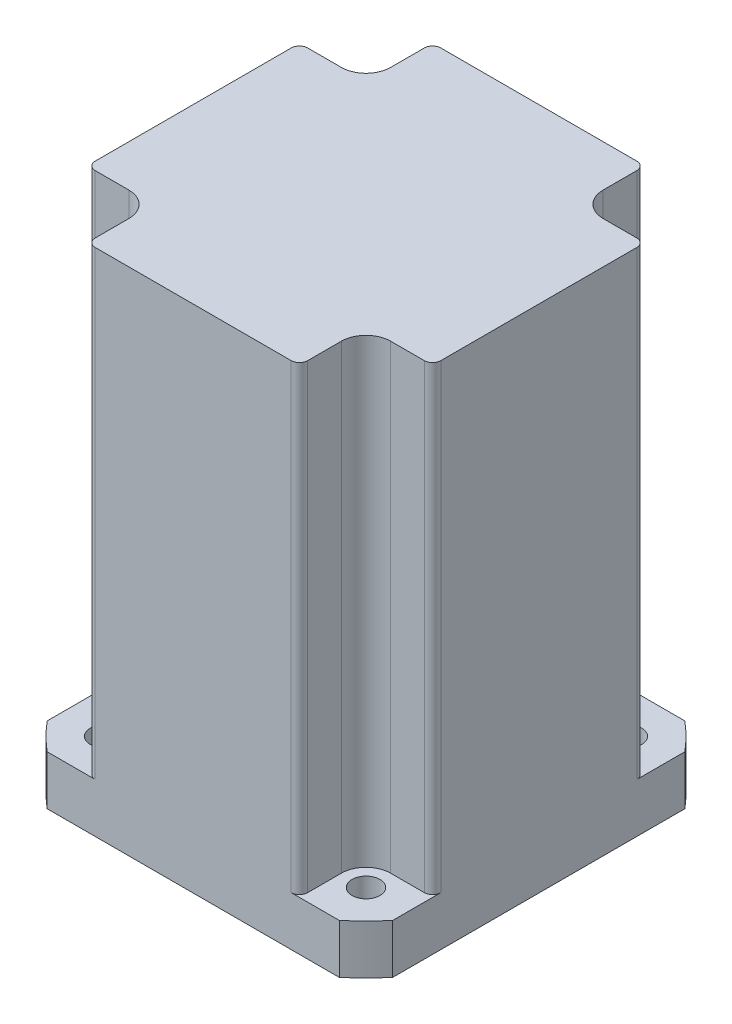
ISO-10303-21;
HEADER;
FILE_DESCRIPTION(('STEP AP214'),'2;1');
FILE_NAME('part.step','',(''),(''),'','','');
FILE_SCHEMA(('AUTOMOTIVE_DESIGN { 1 0 10303 214 1 1 1 1 }'));
ENDSEC;
DATA;
#1=APPLICATION_CONTEXT('core data for automotive mechanical design processes');
#2=APPLICATION_PROTOCOL_DEFINITION('international standard','automotive_design',2000,#1);
#3=PRODUCT_CONTEXT('',#1,'mechanical');
#4=PRODUCT('Part','Part','',(#3));
#5=PRODUCT_RELATED_PRODUCT_CATEGORY('part','',(#4));
#6=PRODUCT_DEFINITION_FORMATION('','',#4);
#7=PRODUCT_DEFINITION_CONTEXT('part definition',#1,'design');
#8=PRODUCT_DEFINITION('design','',#6,#7);
#9=PRODUCT_DEFINITION_SHAPE('','',#8);
#10=(LENGTH_UNIT() NAMED_UNIT(*) SI_UNIT(.MILLI.,.METRE.));
#11=(NAMED_UNIT(*) PLANE_ANGLE_UNIT() SI_UNIT($,.RADIAN.));
#12=(NAMED_UNIT(*) SI_UNIT($,.STERADIAN.) SOLID_ANGLE_UNIT());
#13=UNCERTAINTY_MEASURE_WITH_UNIT(LENGTH_MEASURE(1.E-05),#10,'distance_accuracy_value','');
#14=(GEOMETRIC_REPRESENTATION_CONTEXT(3) GLOBAL_UNCERTAINTY_ASSIGNED_CONTEXT((#13)) GLOBAL_UNIT_ASSIGNED_CONTEXT((#10,
#11,#12)) REPRESENTATION_CONTEXT('',''));
#15=CARTESIAN_POINT('',(0.,0.,0.));
#16=DIRECTION('',(0.,0.,1.));
#17=DIRECTION('',(1.,0.,0.));
#18=AXIS2_PLACEMENT_3D('',#15,#16,#17);
#19=CARTESIAN_POINT('',(-12.9099025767,62.,-12.9099025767));
#20=DIRECTION('',(-1.,0.,0.));
#21=DIRECTION('',(0.,0.,1.));
#22=AXIS2_PLACEMENT_3D('',#19,#20,#21);
#23=PLANE('',#22);
#24=DIRECTION('',(0.,0.,-1.));
#25=VECTOR('',#24,1.);
#26=CARTESIAN_POINT('',(-12.9099025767,62.,21.));
#27=LINE('',#26,#25);
#28=CARTESIAN_POINT('',(-12.9099025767,62.,20.));
#29=VERTEX_POINT('',#28);
#30=CARTESIAN_POINT('',(-12.9099025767,62.,15.9099025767));
#31=VERTEX_POINT('',#30);
#32=EDGE_CURVE('E440',#29,#31,#27,.T.);
#33=ORIENTED_EDGE('',*,*,#32,.T.);
#34=DIRECTION('',(0.,1.,0.));
#35=VECTOR('',#34,1.);
#36=CARTESIAN_POINT('',(-12.9099025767,62.,15.9099025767));
#37=LINE('',#36,#35);
#38=CARTESIAN_POINT('',(-12.9099025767,6.00000000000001,15.9099025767));
#39=VERTEX_POINT('',#38);
#40=EDGE_CURVE('E435',#31,#39,#37,.F.);
#41=ORIENTED_EDGE('',*,*,#40,.T.);
#42=DIRECTION('',(0.,0.,1.));
#43=VECTOR('',#42,1.);
#44=CARTESIAN_POINT('',(-12.9099025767,6.00000000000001,-12.9099025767));
#45=LINE('',#44,#43);
#46=CARTESIAN_POINT('',(-12.9099025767,6.00000000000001,20.));
#47=VERTEX_POINT('',#46);
#48=EDGE_CURVE('E436',#39,#47,#45,.T.);
#49=ORIENTED_EDGE('',*,*,#48,.T.);
#50=DIRECTION('',(0.,1.,0.));
#51=VECTOR('',#50,1.);
#52=CARTESIAN_POINT('',(-12.9099025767,62.,20.));
#53=LINE('',#52,#51);
#54=EDGE_CURVE('E414',#47,#29,#53,.T.);
#55=ORIENTED_EDGE('',*,*,#54,.T.);
#56=EDGE_LOOP('',(#33,#41,#49,#55));
#57=FACE_BOUND('',#56,.T.);
#58=ADVANCED_FACE('F34',(#57),#23,.T.);
#59=CARTESIAN_POINT('',(12.9099025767,62.,-12.9099025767));
#60=DIRECTION('',(-1.,0.,0.));
#61=DIRECTION('',(0.,0.,1.));
#62=AXIS2_PLACEMENT_3D('',#59,#60,#61);
#63=PLANE('',#62);
#64=DIRECTION('',(0.,0.,1.));
#65=VECTOR('',#64,1.);
#66=CARTESIAN_POINT('',(12.9099025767,6.00000000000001,-12.9099025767));
#67=LINE('',#66,#65);
#68=CARTESIAN_POINT('',(12.9099025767,6.00000000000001,15.9099025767));
#69=VERTEX_POINT('',#68);
#70=CARTESIAN_POINT('',(12.9099025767,6.00000000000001,20.));
#71=VERTEX_POINT('',#70);
#72=EDGE_CURVE('E401',#69,#71,#67,.T.);
#73=ORIENTED_EDGE('',*,*,#72,.F.);
#74=DIRECTION('',(0.,-1.,0.));
#75=VECTOR('',#74,1.);
#76=CARTESIAN_POINT('',(12.9099025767,62.,15.9099025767));
#77=LINE('',#76,#75);
#78=CARTESIAN_POINT('',(12.9099025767,62.,15.9099025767));
#79=VERTEX_POINT('',#78);
#80=EDGE_CURVE('E49',#69,#79,#77,.F.);
#81=ORIENTED_EDGE('',*,*,#80,.T.);
#82=DIRECTION('',(0.,0.,-1.));
#83=VECTOR('',#82,1.);
#84=CARTESIAN_POINT('',(12.9099025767,62.,21.));
#85=LINE('',#84,#83);
#86=CARTESIAN_POINT('',(12.9099025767,62.,20.));
#87=VERTEX_POINT('',#86);
#88=EDGE_CURVE('E454',#87,#79,#85,.T.);
#89=ORIENTED_EDGE('',*,*,#88,.F.);
#90=DIRECTION('',(0.,1.,0.));
#91=VECTOR('',#90,1.);
#92=CARTESIAN_POINT('',(12.9099025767,6.00000000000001,20.));
#93=LINE('',#92,#91);
#94=EDGE_CURVE('E412',#87,#71,#93,.F.);
#95=ORIENTED_EDGE('',*,*,#94,.T.);
#96=EDGE_LOOP('',(#73,#81,#89,#95));
#97=FACE_BOUND('',#96,.T.);
#98=ADVANCED_FACE('F659',(#97),#63,.F.);
#99=CARTESIAN_POINT('',(12.9099025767,62.,21.));
#100=DIRECTION('',(0.,1.,0.));
#101=DIRECTION('',(0.,0.,1.));
#102=AXIS2_PLACEMENT_3D('',#99,#100,#101);
#103=PLANE('',#102);
#104=DIRECTION('',(0.,0.,1.));
#105=VECTOR('',#104,1.);
#106=CARTESIAN_POINT('',(21.,62.,12.9099025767));
#107=LINE('',#106,#105);
#108=CARTESIAN_POINT('',(21.,62.,-11.9099025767));
#109=VERTEX_POINT('',#108);
#110=CARTESIAN_POINT('',(21.,62.,11.9099025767));
#111=VERTEX_POINT('',#110);
#112=EDGE_CURVE('E479',#109,#111,#107,.T.);
#113=ORIENTED_EDGE('',*,*,#112,.F.);
#114=CARTESIAN_POINT('',(20.,62.,-11.9099025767));
#115=DIRECTION('',(0.,1.,0.));
#116=DIRECTION('',(0.,0.,1.));
#117=AXIS2_PLACEMENT_3D('',#114,#115,#116);
#118=CIRCLE('',#117,1.);
#119=CARTESIAN_POINT('',(20.,62.,-12.9099025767));
#120=VERTEX_POINT('',#119);
#121=EDGE_CURVE('E514',#109,#120,#118,.T.);
#122=ORIENTED_EDGE('',*,*,#121,.T.);
#123=DIRECTION('',(-1.,0.,0.));
#124=VECTOR('',#123,1.);
#125=CARTESIAN_POINT('',(12.9099025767,62.,-12.9099025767));
#126=LINE('',#125,#124);
#127=CARTESIAN_POINT('',(15.9099025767,62.,-12.9099025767));
#128=VERTEX_POINT('',#127);
#129=EDGE_CURVE('E480',#120,#128,#126,.T.);
#130=ORIENTED_EDGE('',*,*,#129,.T.);
#131=CARTESIAN_POINT('',(15.9099025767,62.,-15.9099025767));
#132=DIRECTION('',(0.,1.,0.));
#133=DIRECTION('',(0.,0.,1.));
#134=AXIS2_PLACEMENT_3D('',#131,#132,#133);
#135=CIRCLE('',#134,3.);
#136=CARTESIAN_POINT('',(12.9099025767,62.,-15.9099025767));
#137=VERTEX_POINT('',#136);
#138=EDGE_CURVE('E42',#128,#137,#135,.F.);
#139=ORIENTED_EDGE('',*,*,#138,.T.);
#140=DIRECTION('',(0.,0.,1.));
#141=VECTOR('',#140,1.);
#142=CARTESIAN_POINT('',(12.9099025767,62.,-21.));
#143=LINE('',#142,#141);
#144=CARTESIAN_POINT('',(12.9099025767,62.,-20.));
#145=VERTEX_POINT('',#144);
#146=EDGE_CURVE('E463',#145,#137,#143,.T.);
#147=ORIENTED_EDGE('',*,*,#146,.F.);
#148=CARTESIAN_POINT('',(11.9099025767,62.,-20.));
#149=DIRECTION('',(0.,1.,0.));
#150=DIRECTION('',(0.,0.,1.));
#151=AXIS2_PLACEMENT_3D('',#148,#149,#150);
#152=CIRCLE('',#151,1.);
#153=CARTESIAN_POINT('',(11.9099025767,62.,-21.));
#154=VERTEX_POINT('',#153);
#155=EDGE_CURVE('E530',#145,#154,#152,.T.);
#156=ORIENTED_EDGE('',*,*,#155,.T.);
#157=DIRECTION('',(1.,0.,0.));
#158=VECTOR('',#157,1.);
#159=CARTESIAN_POINT('',(12.9099025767,62.,-21.));
#160=LINE('',#159,#158);
#161=CARTESIAN_POINT('',(-11.9099025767,62.,-21.));
#162=VERTEX_POINT('',#161);
#163=EDGE_CURVE('E464',#162,#154,#160,.T.);
#164=ORIENTED_EDGE('',*,*,#163,.F.);
#165=CARTESIAN_POINT('',(-11.9099025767,62.,-20.));
#166=DIRECTION('',(0.,1.,0.));
#167=DIRECTION('',(0.,0.,1.));
#168=AXIS2_PLACEMENT_3D('',#165,#166,#167);
#169=CIRCLE('',#168,1.);
#170=CARTESIAN_POINT('',(-12.9099025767,62.,-20.));
#171=VERTEX_POINT('',#170);
#172=EDGE_CURVE('E526',#162,#171,#169,.T.);
#173=ORIENTED_EDGE('',*,*,#172,.T.);
#174=CARTESIAN_POINT('',(-12.9099025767,62.,-15.9099025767));
#175=VERTEX_POINT('',#174);
#176=EDGE_CURVE('E542',#175,#171,#27,.T.);
#177=ORIENTED_EDGE('',*,*,#176,.F.);
#178=CARTESIAN_POINT('',(-15.9099025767,62.,-15.9099025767));
#179=DIRECTION('',(0.,1.,0.));
#180=DIRECTION('',(0.,0.,1.));
#181=AXIS2_PLACEMENT_3D('',#178,#179,#180);
#182=CIRCLE('',#181,3.);
#183=CARTESIAN_POINT('',(-15.9099025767,62.,-12.9099025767));
#184=VERTEX_POINT('',#183);
#185=EDGE_CURVE('E570',#175,#184,#182,.F.);
#186=ORIENTED_EDGE('',*,*,#185,.T.);
#187=DIRECTION('',(1.,0.,0.));
#188=VECTOR('',#187,1.);
#189=CARTESIAN_POINT('',(-21.,62.,-12.9099025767));
#190=LINE('',#189,#188);
#191=CARTESIAN_POINT('',(-20.,62.,-12.9099025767));
#192=VERTEX_POINT('',#191);
#193=EDGE_CURVE('E483',#192,#184,#190,.T.);
#194=ORIENTED_EDGE('',*,*,#193,.F.);
#195=CARTESIAN_POINT('',(-20.,62.,-11.9099025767));
#196=DIRECTION('',(0.,1.,0.));
#197=DIRECTION('',(0.,0.,1.));
#198=AXIS2_PLACEMENT_3D('',#195,#196,#197);
#199=CIRCLE('',#198,1.);
#200=CARTESIAN_POINT('',(-21.,62.,-11.9099025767));
#201=VERTEX_POINT('',#200);
#202=EDGE_CURVE('E643',#192,#201,#199,.T.);
#203=ORIENTED_EDGE('',*,*,#202,.T.);
#204=DIRECTION('',(0.,0.,-1.));
#205=VECTOR('',#204,1.);
#206=CARTESIAN_POINT('',(-21.,62.,-12.9099025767));
#207=LINE('',#206,#205);
#208=CARTESIAN_POINT('',(-21.,62.,11.9099025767));
#209=VERTEX_POINT('',#208);
#210=EDGE_CURVE('E268',#209,#201,#207,.T.);
#211=ORIENTED_EDGE('',*,*,#210,.F.);
#212=CARTESIAN_POINT('',(-20.,62.,11.9099025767));
#213=DIRECTION('',(0.,1.,0.));
#214=DIRECTION('',(0.,0.,1.));
#215=AXIS2_PLACEMENT_3D('',#212,#213,#214);
#216=CIRCLE('',#215,1.);
#217=CARTESIAN_POINT('',(-20.,62.,12.9099025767));
#218=VERTEX_POINT('',#217);
#219=EDGE_CURVE('E624',#209,#218,#216,.T.);
#220=ORIENTED_EDGE('',*,*,#219,.T.);
#221=DIRECTION('',(1.,0.,0.));
#222=VECTOR('',#221,1.);
#223=CARTESIAN_POINT('',(-21.,62.,12.9099025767));
#224=LINE('',#223,#222);
#225=CARTESIAN_POINT('',(-15.9099025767,62.,12.9099025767));
#226=VERTEX_POINT('',#225);
#227=EDGE_CURVE('E486',#218,#226,#224,.T.);
#228=ORIENTED_EDGE('',*,*,#227,.T.);
#229=CARTESIAN_POINT('',(-15.9099025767,62.,15.9099025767));
#230=DIRECTION('',(0.,1.,0.));
#231=DIRECTION('',(0.,0.,1.));
#232=AXIS2_PLACEMENT_3D('',#229,#230,#231);
#233=CIRCLE('',#232,3.);
#234=EDGE_CURVE('E568',#226,#31,#233,.F.);
#235=ORIENTED_EDGE('',*,*,#234,.T.);
#236=ORIENTED_EDGE('',*,*,#32,.F.);
#237=CARTESIAN_POINT('',(-11.9099025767,62.,20.));
#238=DIRECTION('',(0.,1.,0.));
#239=DIRECTION('',(0.,0.,1.));
#240=AXIS2_PLACEMENT_3D('',#237,#238,#239);
#241=CIRCLE('',#240,1.);
#242=CARTESIAN_POINT('',(-11.9099025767,62.,21.));
#243=VERTEX_POINT('',#242);
#244=EDGE_CURVE('E588',#29,#243,#241,.T.);
#245=ORIENTED_EDGE('',*,*,#244,.T.);
#246=DIRECTION('',(-1.,0.,0.));
#247=VECTOR('',#246,1.);
#248=CARTESIAN_POINT('',(12.9099025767,62.,21.));
#249=LINE('',#248,#247);
#250=CARTESIAN_POINT('',(11.9099025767,62.,21.));
#251=VERTEX_POINT('',#250);
#252=EDGE_CURVE('E447',#251,#243,#249,.T.);
#253=ORIENTED_EDGE('',*,*,#252,.F.);
#254=CARTESIAN_POINT('',(11.9099025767,62.,20.));
#255=DIRECTION('',(0.,1.,0.));
#256=DIRECTION('',(0.,0.,1.));
#257=AXIS2_PLACEMENT_3D('',#254,#255,#256);
#258=CIRCLE('',#257,1.);
#259=EDGE_CURVE('E410',#251,#87,#258,.T.);
#260=ORIENTED_EDGE('',*,*,#259,.T.);
#261=ORIENTED_EDGE('',*,*,#88,.T.);
#262=CARTESIAN_POINT('',(15.9099025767,62.,15.9099025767));
#263=DIRECTION('',(0.,1.,0.));
#264=DIRECTION('',(0.,0.,1.));
#265=AXIS2_PLACEMENT_3D('',#262,#263,#264);
#266=CIRCLE('',#265,3.);
#267=CARTESIAN_POINT('',(15.9099025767,62.,12.9099025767));
#268=VERTEX_POINT('',#267);
#269=EDGE_CURVE('E11',#79,#268,#266,.F.);
#270=ORIENTED_EDGE('',*,*,#269,.T.);
#271=DIRECTION('',(-1.,0.,0.));
#272=VECTOR('',#271,1.);
#273=CARTESIAN_POINT('',(21.,62.,12.9099025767));
#274=LINE('',#273,#272);
#275=CARTESIAN_POINT('',(20.,62.,12.9099025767));
#276=VERTEX_POINT('',#275);
#277=EDGE_CURVE('E505',#276,#268,#274,.T.);
#278=ORIENTED_EDGE('',*,*,#277,.F.);
#279=CARTESIAN_POINT('',(20.,62.,11.9099025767));
#280=DIRECTION('',(0.,1.,0.));
#281=DIRECTION('',(0.,0.,1.));
#282=AXIS2_PLACEMENT_3D('',#279,#280,#281);
#283=CIRCLE('',#282,1.);
#284=EDGE_CURVE('E646',#276,#111,#283,.T.);
#285=ORIENTED_EDGE('',*,*,#284,.T.);
#286=EDGE_LOOP('',(#113,#122,#130,#139,#147,#156,#164,#173,#177,#186,#194,#203,#211,#220,#228,
#235,#236,#245,#253,#260,#261,#270,#278,#285));
#287=FACE_BOUND('',#286,.T.);
#288=ADVANCED_FACE('F524',(#287),#103,.T.);
#289=CARTESIAN_POINT('',(12.9099025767,6.00000000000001,21.));
#290=DIRECTION('',(0.,0.,1.));
#291=DIRECTION('',(1.,0.,0.));
#292=AXIS2_PLACEMENT_3D('',#289,#290,#291);
#293=PLANE('',#292);
#294=DIRECTION('',(-1.,0.,0.));
#295=VECTOR('',#294,1.);
#296=CARTESIAN_POINT('',(-17.7552809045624,6.00000000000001,21.));
#297=LINE('',#296,#295);
#298=CARTESIAN_POINT('',(17.7552809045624,6.00000000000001,21.));
#299=VERTEX_POINT('',#298);
#300=CARTESIAN_POINT('',(11.9099025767,6.00000000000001,21.));
#301=VERTEX_POINT('',#300);
#302=EDGE_CURVE('E336',#299,#301,#297,.T.);
#303=ORIENTED_EDGE('',*,*,#302,.T.);
#304=DIRECTION('',(0.,1.,0.));
#305=VECTOR('',#304,1.);
#306=CARTESIAN_POINT('',(11.9099025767,62.,21.));
#307=LINE('',#306,#305);
#308=EDGE_CURVE('E408',#301,#251,#307,.T.);
#309=ORIENTED_EDGE('',*,*,#308,.T.);
#310=ORIENTED_EDGE('',*,*,#252,.T.);
#311=DIRECTION('',(0.,1.,0.));
#312=VECTOR('',#311,1.);
#313=CARTESIAN_POINT('',(-11.9099025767,6.00000000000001,21.));
#314=LINE('',#313,#312);
#315=CARTESIAN_POINT('',(-11.9099025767,6.00000000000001,21.));
#316=VERTEX_POINT('',#315);
#317=EDGE_CURVE('E348',#243,#316,#314,.F.);
#318=ORIENTED_EDGE('',*,*,#317,.T.);
#319=CARTESIAN_POINT('',(-17.7552809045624,6.00000000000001,21.));
#320=VERTEX_POINT('',#319);
#321=EDGE_CURVE('E324',#316,#320,#297,.T.);
#322=ORIENTED_EDGE('',*,*,#321,.T.);
#323=DIRECTION('',(0.,1.,0.));
#324=VECTOR('',#323,1.);
#325=CARTESIAN_POINT('',(-17.7552809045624,0.,21.));
#326=LINE('',#325,#324);
#327=CARTESIAN_POINT('',(-17.7552809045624,0.,21.));
#328=VERTEX_POINT('',#327);
#329=EDGE_CURVE('E292',#328,#320,#326,.T.);
#330=ORIENTED_EDGE('',*,*,#329,.F.);
#331=DIRECTION('',(-1.,0.,0.));
#332=VECTOR('',#331,1.);
#333=CARTESIAN_POINT('',(-17.7552809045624,0.,21.));
#334=LINE('',#333,#332);
#335=CARTESIAN_POINT('',(17.7552809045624,0.,21.));
#336=VERTEX_POINT('',#335);
#337=EDGE_CURVE('E371',#336,#328,#334,.T.);
#338=ORIENTED_EDGE('',*,*,#337,.F.);
#339=DIRECTION('',(0.,1.,0.));
#340=VECTOR('',#339,1.);
#341=CARTESIAN_POINT('',(17.7552809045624,0.,21.));
#342=LINE('',#341,#340);
#343=EDGE_CURVE('E295',#336,#299,#342,.T.);
#344=ORIENTED_EDGE('',*,*,#343,.T.);
#345=EDGE_LOOP('',(#303,#309,#310,#318,#322,#330,#338,#344));
#346=FACE_BOUND('',#345,.T.);
#347=ADVANCED_FACE('F343',(#346),#293,.T.);
#348=CARTESIAN_POINT('',(12.9099025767,62.,-12.9099025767));
#349=DIRECTION('',(0.,0.,-1.));
#350=DIRECTION('',(0.,1.,0.));
#351=AXIS2_PLACEMENT_3D('',#348,#349,#350);
#352=PLANE('',#351);
#353=DIRECTION('',(-1.,0.,0.));
#354=VECTOR('',#353,1.);
#355=CARTESIAN_POINT('',(12.9099025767,6.00000000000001,-12.9099025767));
#356=LINE('',#355,#354);
#357=CARTESIAN_POINT('',(20.,6.00000000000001,-12.9099025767));
#358=VERTEX_POINT('',#357);
#359=CARTESIAN_POINT('',(15.9099025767,6.00000000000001,-12.9099025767));
#360=VERTEX_POINT('',#359);
#361=EDGE_CURVE('E510',#358,#360,#356,.T.);
#362=ORIENTED_EDGE('',*,*,#361,.T.);
#363=DIRECTION('',(0.,-1.,0.));
#364=VECTOR('',#363,1.);
#365=CARTESIAN_POINT('',(15.9099025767,62.,-12.9099025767));
#366=LINE('',#365,#364);
#367=EDGE_CURVE('E561',#360,#128,#366,.F.);
#368=ORIENTED_EDGE('',*,*,#367,.T.);
#369=ORIENTED_EDGE('',*,*,#129,.F.);
#370=DIRECTION('',(0.,1.,0.));
#371=VECTOR('',#370,1.);
#372=CARTESIAN_POINT('',(20.,6.00000000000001,-12.9099025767));
#373=LINE('',#372,#371);
#374=EDGE_CURVE('E516',#120,#358,#373,.F.);
#375=ORIENTED_EDGE('',*,*,#374,.T.);
#376=EDGE_LOOP('',(#362,#368,#369,#375));
#377=FACE_BOUND('',#376,.T.);
#378=ADVANCED_FACE('F583',(#377),#352,.T.);
#379=CARTESIAN_POINT('',(-12.9099025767,6.00000000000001,-20.));
#380=VERTEX_POINT('',#379);
#381=CARTESIAN_POINT('',(-12.9099025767,6.00000000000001,-15.9099025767));
#382=VERTEX_POINT('',#381);
#383=EDGE_CURVE('E439',#380,#382,#45,.T.);
#384=ORIENTED_EDGE('',*,*,#383,.T.);
#385=DIRECTION('',(0.,-1.,0.));
#386=VECTOR('',#385,1.);
#387=CARTESIAN_POINT('',(-12.9099025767,62.,-15.9099025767));
#388=LINE('',#387,#386);
#389=EDGE_CURVE('E554',#382,#175,#388,.F.);
#390=ORIENTED_EDGE('',*,*,#389,.T.);
#391=ORIENTED_EDGE('',*,*,#176,.T.);
#392=DIRECTION('',(0.,1.,0.));
#393=VECTOR('',#392,1.);
#394=CARTESIAN_POINT('',(-12.9099025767,6.00000000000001,-20.));
#395=LINE('',#394,#393);
#396=EDGE_CURVE('E457',#171,#380,#395,.F.);
#397=ORIENTED_EDGE('',*,*,#396,.T.);
#398=EDGE_LOOP('',(#384,#390,#391,#397));
#399=FACE_BOUND('',#398,.T.);
#400=ADVANCED_FACE('F668',(#399),#23,.T.);
#401=CARTESIAN_POINT('',(21.,6.00000000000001,12.9099025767));
#402=DIRECTION('',(0.,0.,-1.));
#403=DIRECTION('',(-1.,0.,0.));
#404=AXIS2_PLACEMENT_3D('',#401,#402,#403);
#405=PLANE('',#404);
#406=ORIENTED_EDGE('',*,*,#277,.T.);
#407=DIRECTION('',(0.,-1.,0.));
#408=VECTOR('',#407,1.);
#409=CARTESIAN_POINT('',(15.9099025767,6.00000000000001,12.9099025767));
#410=LINE('',#409,#408);
#411=CARTESIAN_POINT('',(15.9099025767,6.00000000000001,12.9099025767));
#412=VERTEX_POINT('',#411);
#413=EDGE_CURVE('E563',#268,#412,#410,.T.);
#414=ORIENTED_EDGE('',*,*,#413,.T.);
#415=DIRECTION('',(-1.,0.,0.));
#416=VECTOR('',#415,1.);
#417=CARTESIAN_POINT('',(21.,6.00000000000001,12.9099025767));
#418=LINE('',#417,#416);
#419=CARTESIAN_POINT('',(20.,6.00000000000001,12.9099025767));
#420=VERTEX_POINT('',#419);
#421=EDGE_CURVE('E504',#420,#412,#418,.T.);
#422=ORIENTED_EDGE('',*,*,#421,.F.);
#423=DIRECTION('',(0.,-1.,0.));
#424=VECTOR('',#423,1.);
#425=CARTESIAN_POINT('',(20.,6.00000000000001,12.9099025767));
#426=LINE('',#425,#424);
#427=EDGE_CURVE('E416',#420,#276,#426,.F.);
#428=ORIENTED_EDGE('',*,*,#427,.T.);
#429=EDGE_LOOP('',(#406,#414,#422,#428));
#430=FACE_BOUND('',#429,.T.);
#431=ADVANCED_FACE('F656',(#430),#405,.F.);
#432=CARTESIAN_POINT('',(21.,6.00000000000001,-12.9099025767));
#433=DIRECTION('',(-1.,0.,0.));
#434=DIRECTION('',(0.,-1.,0.));
#435=AXIS2_PLACEMENT_3D('',#432,#433,#434);
#436=PLANE('',#435);
#437=DIRECTION('',(0.,0.,1.));
#438=VECTOR('',#437,1.);
#439=CARTESIAN_POINT('',(21.,6.00000000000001,17.7552809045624));
#440=LINE('',#439,#438);
#441=CARTESIAN_POINT('',(21.,6.00000000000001,-17.7552809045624));
#442=VERTEX_POINT('',#441);
#443=CARTESIAN_POINT('',(21.,6.00000000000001,-11.9099025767));
#444=VERTEX_POINT('',#443);
#445=EDGE_CURVE('E307',#442,#444,#440,.T.);
#446=ORIENTED_EDGE('',*,*,#445,.T.);
#447=DIRECTION('',(0.,1.,0.));
#448=VECTOR('',#447,1.);
#449=CARTESIAN_POINT('',(21.,62.,-11.9099025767));
#450=LINE('',#449,#448);
#451=EDGE_CURVE('E587',#444,#109,#450,.T.);
#452=ORIENTED_EDGE('',*,*,#451,.T.);
#453=ORIENTED_EDGE('',*,*,#112,.T.);
#454=DIRECTION('',(0.,-1.,0.));
#455=VECTOR('',#454,1.);
#456=CARTESIAN_POINT('',(21.,6.00000000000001,11.9099025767));
#457=LINE('',#456,#455);
#458=CARTESIAN_POINT('',(21.,6.00000000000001,11.9099025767));
#459=VERTEX_POINT('',#458);
#460=EDGE_CURVE('E589',#111,#459,#457,.T.);
#461=ORIENTED_EDGE('',*,*,#460,.T.);
#462=CARTESIAN_POINT('',(21.,6.00000000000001,17.7552809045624));
#463=VERTEX_POINT('',#462);
#464=EDGE_CURVE('E322',#459,#463,#440,.T.);
#465=ORIENTED_EDGE('',*,*,#464,.T.);
#466=DIRECTION('',(0.,1.,0.));
#467=VECTOR('',#466,1.);
#468=CARTESIAN_POINT('',(21.,0.,17.7552809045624));
#469=LINE('',#468,#467);
#470=CARTESIAN_POINT('',(21.,0.,17.7552809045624));
#471=VERTEX_POINT('',#470);
#472=EDGE_CURVE('E298',#471,#463,#469,.T.);
#473=ORIENTED_EDGE('',*,*,#472,.F.);
#474=DIRECTION('',(0.,0.,1.));
#475=VECTOR('',#474,1.);
#476=CARTESIAN_POINT('',(21.,0.,17.7552809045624));
#477=LINE('',#476,#475);
#478=CARTESIAN_POINT('',(21.,0.,-17.7552809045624));
#479=VERTEX_POINT('',#478);
#480=EDGE_CURVE('E310',#479,#471,#477,.T.);
#481=ORIENTED_EDGE('',*,*,#480,.F.);
#482=DIRECTION('',(0.,1.,0.));
#483=VECTOR('',#482,1.);
#484=CARTESIAN_POINT('',(21.,0.,-17.7552809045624));
#485=LINE('',#484,#483);
#486=EDGE_CURVE('E273',#479,#442,#485,.T.);
#487=ORIENTED_EDGE('',*,*,#486,.T.);
#488=EDGE_LOOP('',(#446,#452,#453,#461,#465,#473,#481,#487));
#489=FACE_BOUND('',#488,.T.);
#490=ADVANCED_FACE('F305',(#489),#436,.F.);
#491=CARTESIAN_POINT('',(12.9099025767,6.00000000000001,-21.));
#492=DIRECTION('',(-1.,0.,0.));
#493=DIRECTION('',(0.,0.,1.));
#494=AXIS2_PLACEMENT_3D('',#491,#492,#493);
#495=PLANE('',#494);
#496=ORIENTED_EDGE('',*,*,#146,.T.);
#497=DIRECTION('',(0.,-1.,0.));
#498=VECTOR('',#497,1.);
#499=CARTESIAN_POINT('',(12.9099025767,6.00000000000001,-15.9099025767));
#500=LINE('',#499,#498);
#501=CARTESIAN_POINT('',(12.9099025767,6.00000000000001,-15.9099025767));
#502=VERTEX_POINT('',#501);
#503=EDGE_CURVE('E556',#137,#502,#500,.T.);
#504=ORIENTED_EDGE('',*,*,#503,.T.);
#505=DIRECTION('',(0.,0.,1.));
#506=VECTOR('',#505,1.);
#507=CARTESIAN_POINT('',(12.9099025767,6.00000000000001,-21.));
#508=LINE('',#507,#506);
#509=CARTESIAN_POINT('',(12.9099025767,6.00000000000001,-20.));
#510=VERTEX_POINT('',#509);
#511=EDGE_CURVE('E460',#510,#502,#508,.T.);
#512=ORIENTED_EDGE('',*,*,#511,.F.);
#513=DIRECTION('',(0.,-1.,0.));
#514=VECTOR('',#513,1.);
#515=CARTESIAN_POINT('',(12.9099025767,6.00000000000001,-20.));
#516=LINE('',#515,#514);
#517=EDGE_CURVE('E459',#510,#145,#516,.F.);
#518=ORIENTED_EDGE('',*,*,#517,.T.);
#519=EDGE_LOOP('',(#496,#504,#512,#518));
#520=FACE_BOUND('',#519,.T.);
#521=ADVANCED_FACE('F578',(#520),#495,.F.);
#522=CARTESIAN_POINT('',(-12.9099025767,6.00000000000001,-21.));
#523=DIRECTION('',(0.,0.,1.));
#524=DIRECTION('',(0.,-1.,0.));
#525=AXIS2_PLACEMENT_3D('',#522,#523,#524);
#526=PLANE('',#525);
#527=DIRECTION('',(1.,0.,0.));
#528=VECTOR('',#527,1.);
#529=CARTESIAN_POINT('',(17.7552809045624,6.00000000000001,-21.));
#530=LINE('',#529,#528);
#531=CARTESIAN_POINT('',(-17.7552809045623,6.00000000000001,-21.));
#532=VERTEX_POINT('',#531);
#533=CARTESIAN_POINT('',(-11.9099025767,6.00000000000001,-21.));
#534=VERTEX_POINT('',#533);
#535=EDGE_CURVE('E380',#532,#534,#530,.T.);
#536=ORIENTED_EDGE('',*,*,#535,.T.);
#537=DIRECTION('',(0.,1.,0.));
#538=VECTOR('',#537,1.);
#539=CARTESIAN_POINT('',(-11.9099025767,62.,-21.));
#540=LINE('',#539,#538);
#541=EDGE_CURVE('E455',#534,#162,#540,.T.);
#542=ORIENTED_EDGE('',*,*,#541,.T.);
#543=ORIENTED_EDGE('',*,*,#163,.T.);
#544=DIRECTION('',(0.,-1.,0.));
#545=VECTOR('',#544,1.);
#546=CARTESIAN_POINT('',(11.9099025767,6.00000000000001,-21.));
#547=LINE('',#546,#545);
#548=CARTESIAN_POINT('',(11.9099025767,6.00000000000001,-21.));
#549=VERTEX_POINT('',#548);
#550=EDGE_CURVE('E386',#154,#549,#547,.T.);
#551=ORIENTED_EDGE('',*,*,#550,.T.);
#552=CARTESIAN_POINT('',(17.7552809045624,6.00000000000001,-21.));
#553=VERTEX_POINT('',#552);
#554=EDGE_CURVE('E375',#549,#553,#530,.T.);
#555=ORIENTED_EDGE('',*,*,#554,.T.);
#556=DIRECTION('',(0.,1.,0.));
#557=VECTOR('',#556,1.);
#558=CARTESIAN_POINT('',(17.7552809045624,0.,-21.));
#559=LINE('',#558,#557);
#560=CARTESIAN_POINT('',(17.7552809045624,0.,-21.));
#561=VERTEX_POINT('',#560);
#562=EDGE_CURVE('E250',#561,#553,#559,.T.);
#563=ORIENTED_EDGE('',*,*,#562,.F.);
#564=DIRECTION('',(1.,0.,0.));
#565=VECTOR('',#564,1.);
#566=CARTESIAN_POINT('',(17.7552809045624,0.,-21.));
#567=LINE('',#566,#565);
#568=CARTESIAN_POINT('',(-17.7552809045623,0.,-21.));
#569=VERTEX_POINT('',#568);
#570=EDGE_CURVE('E243',#569,#561,#567,.T.);
#571=ORIENTED_EDGE('',*,*,#570,.F.);
#572=DIRECTION('',(0.,1.,0.));
#573=VECTOR('',#572,1.);
#574=CARTESIAN_POINT('',(-17.7552809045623,0.,-21.));
#575=LINE('',#574,#573);
#576=EDGE_CURVE('E247',#569,#532,#575,.T.);
#577=ORIENTED_EDGE('',*,*,#576,.T.);
#578=EDGE_LOOP('',(#536,#542,#543,#551,#555,#563,#571,#577));
#579=FACE_BOUND('',#578,.T.);
#580=ADVANCED_FACE('F245',(#579),#526,.F.);
#581=CARTESIAN_POINT('',(-21.,62.,12.9099025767));
#582=DIRECTION('',(0.,0.,-1.));
#583=DIRECTION('',(-1.,0.,0.));
#584=AXIS2_PLACEMENT_3D('',#581,#582,#583);
#585=PLANE('',#584);
#586=DIRECTION('',(1.,0.,0.));
#587=VECTOR('',#586,1.);
#588=CARTESIAN_POINT('',(-21.,6.00000000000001,12.9099025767));
#589=LINE('',#588,#587);
#590=CARTESIAN_POINT('',(-20.,6.00000000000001,12.9099025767));
#591=VERTEX_POINT('',#590);
#592=CARTESIAN_POINT('',(-15.9099025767,6.00000000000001,12.9099025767));
#593=VERTEX_POINT('',#592);
#594=EDGE_CURVE('E271',#591,#593,#589,.T.);
#595=ORIENTED_EDGE('',*,*,#594,.T.);
#596=DIRECTION('',(0.,1.,0.));
#597=VECTOR('',#596,1.);
#598=CARTESIAN_POINT('',(-15.9099025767,62.,12.9099025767));
#599=LINE('',#598,#597);
#600=EDGE_CURVE('E432',#593,#226,#599,.T.);
#601=ORIENTED_EDGE('',*,*,#600,.T.);
#602=ORIENTED_EDGE('',*,*,#227,.F.);
#603=DIRECTION('',(0.,1.,0.));
#604=VECTOR('',#603,1.);
#605=CARTESIAN_POINT('',(-20.,62.,12.9099025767));
#606=LINE('',#605,#604);
#607=EDGE_CURVE('E502',#218,#591,#606,.F.);
#608=ORIENTED_EDGE('',*,*,#607,.T.);
#609=EDGE_LOOP('',(#595,#601,#602,#608));
#610=FACE_BOUND('',#609,.T.);
#611=ADVANCED_FACE('F620',(#610),#585,.F.);
#612=CARTESIAN_POINT('',(-21.,6.00000000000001,-12.9099025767));
#613=DIRECTION('',(0.,0.,1.));
#614=DIRECTION('',(1.,0.,0.));
#615=AXIS2_PLACEMENT_3D('',#612,#613,#614);
#616=PLANE('',#615);
#617=ORIENTED_EDGE('',*,*,#193,.T.);
#618=DIRECTION('',(0.,-1.,0.));
#619=VECTOR('',#618,1.);
#620=CARTESIAN_POINT('',(-15.9099025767,6.00000000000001,-12.9099025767));
#621=LINE('',#620,#619);
#622=CARTESIAN_POINT('',(-15.9099025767,6.00000000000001,-12.9099025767));
#623=VERTEX_POINT('',#622);
#624=EDGE_CURVE('E615',#184,#623,#621,.T.);
#625=ORIENTED_EDGE('',*,*,#624,.T.);
#626=DIRECTION('',(1.,0.,0.));
#627=VECTOR('',#626,1.);
#628=CARTESIAN_POINT('',(-21.,6.00000000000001,-12.9099025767));
#629=LINE('',#628,#627);
#630=CARTESIAN_POINT('',(-20.,6.00000000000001,-12.9099025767));
#631=VERTEX_POINT('',#630);
#632=EDGE_CURVE('E487',#631,#623,#629,.T.);
#633=ORIENTED_EDGE('',*,*,#632,.F.);
#634=DIRECTION('',(0.,-1.,0.));
#635=VECTOR('',#634,1.);
#636=CARTESIAN_POINT('',(-20.,6.00000000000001,-12.9099025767));
#637=LINE('',#636,#635);
#638=EDGE_CURVE('E500',#631,#192,#637,.F.);
#639=ORIENTED_EDGE('',*,*,#638,.T.);
#640=EDGE_LOOP('',(#617,#625,#633,#639));
#641=FACE_BOUND('',#640,.T.);
#642=ADVANCED_FACE('F636',(#641),#616,.F.);
#643=CARTESIAN_POINT('',(-21.,6.00000000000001,12.9099025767));
#644=DIRECTION('',(1.,0.,0.));
#645=DIRECTION('',(0.,1.,0.));
#646=AXIS2_PLACEMENT_3D('',#643,#644,#645);
#647=PLANE('',#646);
#648=CARTESIAN_POINT('',(-21.,50.8,0.));
#649=DIRECTION('',(1.,0.,0.));
#650=DIRECTION('',(0.,1.,0.));
#651=AXIS2_PLACEMENT_3D('',#648,#649,#650);
#652=CIRCLE('',#651,1.20011684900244);
#653=CARTESIAN_POINT('',(-21.,52.0001168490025,0.));
#654=VERTEX_POINT('',#653);
#655=EDGE_CURVE('E596',#654,#654,#652,.T.);
#656=ORIENTED_EDGE('',*,*,#655,.T.);
#657=EDGE_LOOP('',(#656));
#658=FACE_BOUND('',#657,.T.);
#659=CARTESIAN_POINT('',(-21.,50.8,-9.70000000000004));
#660=DIRECTION('',(1.,0.,0.));
#661=DIRECTION('',(0.,1.,0.));
#662=AXIS2_PLACEMENT_3D('',#659,#660,#661);
#663=CIRCLE('',#662,1.20011684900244);
#664=CARTESIAN_POINT('',(-21.,52.0001168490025,-9.70000000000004));
#665=VERTEX_POINT('',#664);
#666=EDGE_CURVE('E599',#665,#665,#663,.T.);
#667=ORIENTED_EDGE('',*,*,#666,.T.);
#668=EDGE_LOOP('',(#667));
#669=FACE_BOUND('',#668,.T.);
#670=ORIENTED_EDGE('',*,*,#210,.T.);
#671=DIRECTION('',(0.,-1.,0.));
#672=VECTOR('',#671,1.);
#673=CARTESIAN_POINT('',(-21.,6.00000000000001,-11.9099025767));
#674=LINE('',#673,#672);
#675=CARTESIAN_POINT('',(-21.,6.00000000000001,-11.9099025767));
#676=VERTEX_POINT('',#675);
#677=EDGE_CURVE('E625',#201,#676,#674,.T.);
#678=ORIENTED_EDGE('',*,*,#677,.T.);
#679=DIRECTION('',(0.,0.,-1.));
#680=VECTOR('',#679,1.);
#681=CARTESIAN_POINT('',(-21.,6.00000000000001,-17.7552809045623));
#682=LINE('',#681,#680);
#683=CARTESIAN_POINT('',(-21.,6.00000000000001,-17.7552809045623));
#684=VERTEX_POINT('',#683);
#685=EDGE_CURVE('E279',#676,#684,#682,.T.);
#686=ORIENTED_EDGE('',*,*,#685,.T.);
#687=DIRECTION('',(0.,1.,0.));
#688=VECTOR('',#687,1.);
#689=CARTESIAN_POINT('',(-21.,0.,-17.7552809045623));
#690=LINE('',#689,#688);
#691=CARTESIAN_POINT('',(-21.,0.,-17.7552809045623));
#692=VERTEX_POINT('',#691);
#693=EDGE_CURVE('E286',#692,#684,#690,.T.);
#694=ORIENTED_EDGE('',*,*,#693,.F.);
#695=DIRECTION('',(0.,0.,-1.));
#696=VECTOR('',#695,1.);
#697=CARTESIAN_POINT('',(-21.,0.,-17.7552809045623));
#698=LINE('',#697,#696);
#699=CARTESIAN_POINT('',(-21.,0.,17.7552809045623));
#700=VERTEX_POINT('',#699);
#701=EDGE_CURVE('E259',#700,#692,#698,.T.);
#702=ORIENTED_EDGE('',*,*,#701,.F.);
#703=DIRECTION('',(0.,1.,0.));
#704=VECTOR('',#703,1.);
#705=CARTESIAN_POINT('',(-21.,0.,17.7552809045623));
#706=LINE('',#705,#704);
#707=CARTESIAN_POINT('',(-21.,6.00000000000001,17.7552809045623));
#708=VERTEX_POINT('',#707);
#709=EDGE_CURVE('E289',#700,#708,#706,.T.);
#710=ORIENTED_EDGE('',*,*,#709,.T.);
#711=CARTESIAN_POINT('',(-21.,6.00000000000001,11.9099025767));
#712=VERTEX_POINT('',#711);
#713=EDGE_CURVE('E263',#708,#712,#682,.T.);
#714=ORIENTED_EDGE('',*,*,#713,.T.);
#715=DIRECTION('',(0.,1.,0.));
#716=VECTOR('',#715,1.);
#717=CARTESIAN_POINT('',(-21.,6.00000000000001,11.9099025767));
#718=LINE('',#717,#716);
#719=EDGE_CURVE('E368',#712,#209,#718,.T.);
#720=ORIENTED_EDGE('',*,*,#719,.T.);
#721=EDGE_LOOP('',(#670,#678,#686,#694,#702,#710,#714,#720));
#722=FACE_BOUND('',#721,.T.);
#723=ADVANCED_FACE('F367',(#658,#669,#722),#647,.F.);
#724=CARTESIAN_POINT('',(0.,6.00000000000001,0.));
#725=DIRECTION('',(0.,1.,0.));
#726=DIRECTION('',(0.,0.,1.));
#727=AXIS2_PLACEMENT_3D('',#724,#725,#726);
#728=PLANE('',#727);
#729=CARTESIAN_POINT('',(15.9099025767,6.00000000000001,-15.9099025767));
#730=DIRECTION('',(0.,1.,0.));
#731=DIRECTION('',(0.,0.,1.));
#732=AXIS2_PLACEMENT_3D('',#729,#730,#731);
#733=CIRCLE('',#732,1.69999999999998);
#734=CARTESIAN_POINT('',(15.9099025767,6.00000000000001,-14.2099025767));
#735=VERTEX_POINT('',#734);
#736=EDGE_CURVE('E1085',#735,#735,#733,.T.);
#737=ORIENTED_EDGE('',*,*,#736,.F.);
#738=EDGE_LOOP('',(#737));
#739=FACE_BOUND('',#738,.T.);
#740=ORIENTED_EDGE('',*,*,#511,.T.);
#741=CARTESIAN_POINT('',(15.9099025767,6.00000000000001,-15.9099025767));
#742=DIRECTION('',(0.,1.,0.));
#743=DIRECTION('',(0.,0.,1.));
#744=AXIS2_PLACEMENT_3D('',#741,#742,#743);
#745=CIRCLE('',#744,3.);
#746=EDGE_CURVE('E559',#502,#360,#745,.T.);
#747=ORIENTED_EDGE('',*,*,#746,.T.);
#748=ORIENTED_EDGE('',*,*,#361,.F.);
#749=CARTESIAN_POINT('',(20.,6.00000000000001,-11.9099025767));
#750=DIRECTION('',(0.,1.,0.));
#751=DIRECTION('',(0.,0.,1.));
#752=AXIS2_PLACEMENT_3D('',#749,#750,#751);
#753=CIRCLE('',#752,1.);
#754=EDGE_CURVE('E319',#358,#444,#753,.F.);
#755=ORIENTED_EDGE('',*,*,#754,.T.);
#756=ORIENTED_EDGE('',*,*,#445,.F.);
#757=CARTESIAN_POINT('',(0.,6.00000000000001,0.));
#758=DIRECTION('',(0.,-1.,0.));
#759=DIRECTION('',(0.,0.,1.));
#760=AXIS2_PLACEMENT_3D('',#757,#758,#759);
#761=CIRCLE('',#760,27.4999999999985);
#762=EDGE_CURVE('E316',#553,#442,#761,.T.);
#763=ORIENTED_EDGE('',*,*,#762,.F.);
#764=ORIENTED_EDGE('',*,*,#554,.F.);
#765=CARTESIAN_POINT('',(11.9099025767,6.00000000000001,-20.));
#766=DIRECTION('',(0.,1.,0.));
#767=DIRECTION('',(0.,0.,1.));
#768=AXIS2_PLACEMENT_3D('',#765,#766,#767);
#769=CIRCLE('',#768,1.);
#770=EDGE_CURVE('E425',#549,#510,#769,.F.);
#771=ORIENTED_EDGE('',*,*,#770,.T.);
#772=EDGE_LOOP('',(#740,#747,#748,#755,#756,#763,#764,#771));
#773=FACE_BOUND('',#772,.T.);
#774=ADVANCED_FACE('F315',(#739,#773),#728,.T.);
#775=CARTESIAN_POINT('',(-15.9099025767,6.00000000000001,15.9099025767));
#776=DIRECTION('',(0.,1.,0.));
#777=DIRECTION('',(0.,0.,1.));
#778=AXIS2_PLACEMENT_3D('',#775,#776,#777);
#779=CIRCLE('',#778,1.69999999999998);
#780=CARTESIAN_POINT('',(-15.9099025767,6.00000000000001,17.6099025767));
#781=VERTEX_POINT('',#780);
#782=EDGE_CURVE('E1097',#781,#781,#779,.T.);
#783=ORIENTED_EDGE('',*,*,#782,.F.);
#784=EDGE_LOOP('',(#783));
#785=FACE_BOUND('',#784,.T.);
#786=ORIENTED_EDGE('',*,*,#48,.F.);
#787=CARTESIAN_POINT('',(-15.9099025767,6.00000000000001,15.9099025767));
#788=DIRECTION('',(0.,1.,0.));
#789=DIRECTION('',(0.,0.,1.));
#790=AXIS2_PLACEMENT_3D('',#787,#788,#789);
#791=CIRCLE('',#790,3.);
#792=EDGE_CURVE('E609',#39,#593,#791,.T.);
#793=ORIENTED_EDGE('',*,*,#792,.T.);
#794=ORIENTED_EDGE('',*,*,#594,.F.);
#795=CARTESIAN_POINT('',(-20.,6.00000000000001,11.9099025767));
#796=DIRECTION('',(0.,1.,0.));
#797=DIRECTION('',(0.,0.,1.));
#798=AXIS2_PLACEMENT_3D('',#795,#796,#797);
#799=CIRCLE('',#798,1.);
#800=EDGE_CURVE('E363',#591,#712,#799,.F.);
#801=ORIENTED_EDGE('',*,*,#800,.T.);
#802=ORIENTED_EDGE('',*,*,#713,.F.);
#803=CARTESIAN_POINT('',(0.,6.00000000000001,0.));
#804=DIRECTION('',(0.,-1.,0.));
#805=DIRECTION('',(0.,0.,1.));
#806=AXIS2_PLACEMENT_3D('',#803,#804,#805);
#807=CIRCLE('',#806,27.4999999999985);
#808=EDGE_CURVE('E284',#320,#708,#807,.T.);
#809=ORIENTED_EDGE('',*,*,#808,.F.);
#810=ORIENTED_EDGE('',*,*,#321,.F.);
#811=CARTESIAN_POINT('',(-11.9099025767,6.00000000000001,20.));
#812=DIRECTION('',(0.,1.,0.));
#813=DIRECTION('',(0.,0.,1.));
#814=AXIS2_PLACEMENT_3D('',#811,#812,#813);
#815=CIRCLE('',#814,1.);
#816=EDGE_CURVE('E405',#316,#47,#815,.F.);
#817=ORIENTED_EDGE('',*,*,#816,.T.);
#818=EDGE_LOOP('',(#786,#793,#794,#801,#802,#809,#810,#817));
#819=FACE_BOUND('',#818,.T.);
#820=ADVANCED_FACE('F359',(#785,#819),#728,.T.);
#821=CARTESIAN_POINT('',(-15.9099025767,6.00000000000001,-15.9099025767));
#822=DIRECTION('',(0.,1.,0.));
#823=DIRECTION('',(0.,0.,1.));
#824=AXIS2_PLACEMENT_3D('',#821,#822,#823);
#825=CIRCLE('',#824,1.69999999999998);
#826=CARTESIAN_POINT('',(-15.9099025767,6.00000000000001,-14.2099025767));
#827=VERTEX_POINT('',#826);
#828=EDGE_CURVE('E1091',#827,#827,#825,.T.);
#829=ORIENTED_EDGE('',*,*,#828,.F.);
#830=EDGE_LOOP('',(#829));
#831=FACE_BOUND('',#830,.T.);
#832=ORIENTED_EDGE('',*,*,#632,.T.);
#833=CARTESIAN_POINT('',(-15.9099025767,6.00000000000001,-15.9099025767));
#834=DIRECTION('',(0.,1.,0.));
#835=DIRECTION('',(0.,0.,1.));
#836=AXIS2_PLACEMENT_3D('',#833,#834,#835);
#837=CIRCLE('',#836,3.);
#838=EDGE_CURVE('E552',#623,#382,#837,.T.);
#839=ORIENTED_EDGE('',*,*,#838,.T.);
#840=ORIENTED_EDGE('',*,*,#383,.F.);
#841=CARTESIAN_POINT('',(-11.9099025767,6.00000000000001,-20.));
#842=DIRECTION('',(0.,1.,0.));
#843=DIRECTION('',(0.,0.,1.));
#844=AXIS2_PLACEMENT_3D('',#841,#842,#843);
#845=CIRCLE('',#844,1.);
#846=EDGE_CURVE('E423',#380,#534,#845,.F.);
#847=ORIENTED_EDGE('',*,*,#846,.T.);
#848=ORIENTED_EDGE('',*,*,#535,.F.);
#849=CARTESIAN_POINT('',(0.,6.00000000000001,0.));
#850=DIRECTION('',(0.,-1.,0.));
#851=DIRECTION('',(0.,0.,1.));
#852=AXIS2_PLACEMENT_3D('',#849,#850,#851);
#853=CIRCLE('',#852,27.4999999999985);
#854=EDGE_CURVE('E267',#684,#532,#853,.T.);
#855=ORIENTED_EDGE('',*,*,#854,.F.);
#856=ORIENTED_EDGE('',*,*,#685,.F.);
#857=CARTESIAN_POINT('',(-20.,6.00000000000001,-11.9099025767));
#858=DIRECTION('',(0.,1.,0.));
#859=DIRECTION('',(0.,0.,1.));
#860=AXIS2_PLACEMENT_3D('',#857,#858,#859);
#861=CIRCLE('',#860,1.);
#862=EDGE_CURVE('E427',#676,#631,#861,.F.);
#863=ORIENTED_EDGE('',*,*,#862,.T.);
#864=EDGE_LOOP('',(#832,#839,#840,#847,#848,#855,#856,#863));
#865=FACE_BOUND('',#864,.T.);
#866=ADVANCED_FACE('F631',(#831,#865),#728,.T.);
#867=CARTESIAN_POINT('',(0.,0.,0.));
#868=DIRECTION('',(0.,1.,0.));
#869=DIRECTION('',(0.,0.,1.));
#870=AXIS2_PLACEMENT_3D('',#867,#868,#869);
#871=CYLINDRICAL_SURFACE('',#870,27.4999999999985);
#872=ORIENTED_EDGE('',*,*,#854,.T.);
#873=ORIENTED_EDGE('',*,*,#576,.F.);
#874=CARTESIAN_POINT('',(0.,0.,0.));
#875=DIRECTION('',(0.,-1.,0.));
#876=DIRECTION('',(0.,0.,1.));
#877=AXIS2_PLACEMENT_3D('',#874,#875,#876);
#878=CIRCLE('',#877,27.4999999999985);
#879=EDGE_CURVE('E254',#692,#569,#878,.T.);
#880=ORIENTED_EDGE('',*,*,#879,.F.);
#881=ORIENTED_EDGE('',*,*,#693,.T.);
#882=EDGE_LOOP('',(#872,#873,#880,#881));
#883=FACE_BOUND('',#882,.T.);
#884=ADVANCED_FACE('F265',(#883),#871,.T.);
#885=CARTESIAN_POINT('',(0.,0.,0.));
#886=DIRECTION('',(0.,1.,0.));
#887=DIRECTION('',(0.,0.,1.));
#888=AXIS2_PLACEMENT_3D('',#885,#886,#887);
#889=CYLINDRICAL_SURFACE('',#888,27.4999999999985);
#890=ORIENTED_EDGE('',*,*,#762,.T.);
#891=ORIENTED_EDGE('',*,*,#486,.F.);
#892=CARTESIAN_POINT('',(0.,0.,0.));
#893=DIRECTION('',(0.,-1.,0.));
#894=DIRECTION('',(0.,0.,1.));
#895=AXIS2_PLACEMENT_3D('',#892,#893,#894);
#896=CIRCLE('',#895,27.4999999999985);
#897=EDGE_CURVE('E253',#561,#479,#896,.T.);
#898=ORIENTED_EDGE('',*,*,#897,.F.);
#899=ORIENTED_EDGE('',*,*,#562,.T.);
#900=EDGE_LOOP('',(#890,#891,#898,#899));
#901=FACE_BOUND('',#900,.T.);
#902=ADVANCED_FACE('F388',(#901),#889,.T.);
#903=CARTESIAN_POINT('',(0.,0.,0.));
#904=DIRECTION('',(0.,1.,0.));
#905=DIRECTION('',(0.,0.,1.));
#906=AXIS2_PLACEMENT_3D('',#903,#904,#905);
#907=CYLINDRICAL_SURFACE('',#906,27.4999999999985);
#908=CARTESIAN_POINT('',(0.,6.00000000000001,0.));
#909=DIRECTION('',(0.,-1.,0.));
#910=DIRECTION('',(0.,0.,1.));
#911=AXIS2_PLACEMENT_3D('',#908,#909,#910);
#912=CIRCLE('',#911,27.4999999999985);
#913=EDGE_CURVE('E321',#463,#299,#912,.T.);
#914=ORIENTED_EDGE('',*,*,#913,.T.);
#915=ORIENTED_EDGE('',*,*,#343,.F.);
#916=CARTESIAN_POINT('',(0.,0.,0.));
#917=DIRECTION('',(0.,-1.,0.));
#918=DIRECTION('',(0.,0.,1.));
#919=AXIS2_PLACEMENT_3D('',#916,#917,#918);
#920=CIRCLE('',#919,27.4999999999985);
#921=EDGE_CURVE('E390',#471,#336,#920,.T.);
#922=ORIENTED_EDGE('',*,*,#921,.F.);
#923=ORIENTED_EDGE('',*,*,#472,.T.);
#924=EDGE_LOOP('',(#914,#915,#922,#923));
#925=FACE_BOUND('',#924,.T.);
#926=ADVANCED_FACE('F897',(#925),#907,.T.);
#927=CARTESIAN_POINT('',(0.,0.,0.));
#928=DIRECTION('',(0.,1.,0.));
#929=DIRECTION('',(0.,0.,1.));
#930=AXIS2_PLACEMENT_3D('',#927,#928,#929);
#931=CYLINDRICAL_SURFACE('',#930,27.4999999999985);
#932=ORIENTED_EDGE('',*,*,#808,.T.);
#933=ORIENTED_EDGE('',*,*,#709,.F.);
#934=CARTESIAN_POINT('',(0.,0.,0.));
#935=DIRECTION('',(0.,-1.,0.));
#936=DIRECTION('',(0.,0.,1.));
#937=AXIS2_PLACEMENT_3D('',#934,#935,#936);
#938=CIRCLE('',#937,27.4999999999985);
#939=EDGE_CURVE('E356',#328,#700,#938,.T.);
#940=ORIENTED_EDGE('',*,*,#939,.F.);
#941=ORIENTED_EDGE('',*,*,#329,.T.);
#942=EDGE_LOOP('',(#932,#933,#940,#941));
#943=FACE_BOUND('',#942,.T.);
#944=ADVANCED_FACE('F354',(#943),#931,.T.);
#945=CARTESIAN_POINT('',(0.,0.,0.));
#946=DIRECTION('',(0.,1.,0.));
#947=DIRECTION('',(0.,0.,1.));
#948=AXIS2_PLACEMENT_3D('',#945,#946,#947);
#949=PLANE('',#948);
#950=CARTESIAN_POINT('',(15.9099025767,0.,-15.9099025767));
#951=DIRECTION('',(0.,-1.,0.));
#952=DIRECTION('',(0.,0.,-1.));
#953=AXIS2_PLACEMENT_3D('',#950,#951,#952);
#954=CIRCLE('',#953,1.69999999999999);
#955=CARTESIAN_POINT('',(15.9099025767,0.,-17.6099025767));
#956=VERTEX_POINT('',#955);
#957=EDGE_CURVE('E1080',#956,#956,#954,.T.);
#958=ORIENTED_EDGE('',*,*,#957,.F.);
#959=EDGE_LOOP('',(#958));
#960=FACE_BOUND('',#959,.T.);
#961=CARTESIAN_POINT('',(-15.9099025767,0.,-15.9099025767));
#962=DIRECTION('',(0.,-1.,0.));
#963=DIRECTION('',(0.,0.,-1.));
#964=AXIS2_PLACEMENT_3D('',#961,#962,#963);
#965=CIRCLE('',#964,1.69999999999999);
#966=CARTESIAN_POINT('',(-15.9099025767,0.,-17.6099025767));
#967=VERTEX_POINT('',#966);
#968=EDGE_CURVE('E1088',#967,#967,#965,.T.);
#969=ORIENTED_EDGE('',*,*,#968,.F.);
#970=EDGE_LOOP('',(#969));
#971=FACE_BOUND('',#970,.T.);
#972=CARTESIAN_POINT('',(-15.9099025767,0.,15.9099025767));
#973=DIRECTION('',(0.,-1.,0.));
#974=DIRECTION('',(0.,0.,-1.));
#975=AXIS2_PLACEMENT_3D('',#972,#973,#974);
#976=CIRCLE('',#975,1.69999999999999);
#977=CARTESIAN_POINT('',(-15.9099025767,0.,14.2099025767));
#978=VERTEX_POINT('',#977);
#979=EDGE_CURVE('E1094',#978,#978,#976,.T.);
#980=ORIENTED_EDGE('',*,*,#979,.F.);
#981=EDGE_LOOP('',(#980));
#982=FACE_BOUND('',#981,.T.);
#983=CARTESIAN_POINT('',(15.9099025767,0.,15.9099025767));
#984=DIRECTION('',(0.,-1.,0.));
#985=DIRECTION('',(0.,0.,-1.));
#986=AXIS2_PLACEMENT_3D('',#983,#984,#985);
#987=CIRCLE('',#986,1.69999999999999);
#988=CARTESIAN_POINT('',(15.9099025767,0.,14.2099025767));
#989=VERTEX_POINT('',#988);
#990=EDGE_CURVE('E1100',#989,#989,#987,.T.);
#991=ORIENTED_EDGE('',*,*,#990,.F.);
#992=EDGE_LOOP('',(#991));
#993=FACE_BOUND('',#992,.T.);
#994=ORIENTED_EDGE('',*,*,#879,.T.);
#995=ORIENTED_EDGE('',*,*,#570,.T.);
#996=ORIENTED_EDGE('',*,*,#897,.T.);
#997=ORIENTED_EDGE('',*,*,#480,.T.);
#998=ORIENTED_EDGE('',*,*,#921,.T.);
#999=ORIENTED_EDGE('',*,*,#337,.T.);
#1000=ORIENTED_EDGE('',*,*,#939,.T.);
#1001=ORIENTED_EDGE('',*,*,#701,.T.);
#1002=EDGE_LOOP('',(#994,#995,#996,#997,#998,#999,#1000,#1001));
#1003=FACE_BOUND('',#1002,.T.);
#1004=ADVANCED_FACE('F257',(#960,#971,#982,#993,#1003),#949,.F.);
#1005=CARTESIAN_POINT('',(15.9099025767,6.00000000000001,15.9099025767));
#1006=DIRECTION('',(0.,1.,0.));
#1007=DIRECTION('',(0.,0.,1.));
#1008=AXIS2_PLACEMENT_3D('',#1005,#1006,#1007);
#1009=CIRCLE('',#1008,1.69999999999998);
#1010=CARTESIAN_POINT('',(15.9099025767,6.00000000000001,17.6099025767));
#1011=VERTEX_POINT('',#1010);
#1012=EDGE_CURVE('E376',#1011,#1011,#1009,.T.);
#1013=ORIENTED_EDGE('',*,*,#1012,.F.);
#1014=EDGE_LOOP('',(#1013));
#1015=FACE_BOUND('',#1014,.T.);
#1016=ORIENTED_EDGE('',*,*,#421,.T.);
#1017=CARTESIAN_POINT('',(15.9099025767,6.00000000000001,15.9099025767));
#1018=DIRECTION('',(0.,1.,0.));
#1019=DIRECTION('',(0.,0.,1.));
#1020=AXIS2_PLACEMENT_3D('',#1017,#1018,#1019);
#1021=CIRCLE('',#1020,3.);
#1022=EDGE_CURVE('E57',#412,#69,#1021,.T.);
#1023=ORIENTED_EDGE('',*,*,#1022,.T.);
#1024=ORIENTED_EDGE('',*,*,#72,.T.);
#1025=CARTESIAN_POINT('',(11.9099025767,6.00000000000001,20.));
#1026=DIRECTION('',(0.,1.,0.));
#1027=DIRECTION('',(0.,0.,1.));
#1028=AXIS2_PLACEMENT_3D('',#1025,#1026,#1027);
#1029=CIRCLE('',#1028,1.);
#1030=EDGE_CURVE('E399',#71,#301,#1029,.F.);
#1031=ORIENTED_EDGE('',*,*,#1030,.T.);
#1032=ORIENTED_EDGE('',*,*,#302,.F.);
#1033=ORIENTED_EDGE('',*,*,#913,.F.);
#1034=ORIENTED_EDGE('',*,*,#464,.F.);
#1035=CARTESIAN_POINT('',(20.,6.00000000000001,11.9099025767));
#1036=DIRECTION('',(0.,1.,0.));
#1037=DIRECTION('',(0.,0.,1.));
#1038=AXIS2_PLACEMENT_3D('',#1035,#1036,#1037);
#1039=CIRCLE('',#1038,1.);
#1040=EDGE_CURVE('E406',#459,#420,#1039,.F.);
#1041=ORIENTED_EDGE('',*,*,#1040,.T.);
#1042=EDGE_LOOP('',(#1016,#1023,#1024,#1031,#1032,#1033,#1034,#1041));
#1043=FACE_BOUND('',#1042,.T.);
#1044=ADVANCED_FACE('F397',(#1015,#1043),#728,.T.);
#1045=CARTESIAN_POINT('',(15.9099025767,0.,15.9099025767));
#1046=DIRECTION('',(0.,-1.,0.));
#1047=DIRECTION('',(0.,0.,-1.));
#1048=AXIS2_PLACEMENT_3D('',#1045,#1046,#1047);
#1049=CYLINDRICAL_SURFACE('',#1048,1.69999999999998);
#1050=ORIENTED_EDGE('',*,*,#1012,.T.);
#1051=EDGE_LOOP('',(#1050));
#1052=FACE_BOUND('',#1051,.T.);
#1053=ORIENTED_EDGE('',*,*,#990,.T.);
#1054=EDGE_LOOP('',(#1053));
#1055=FACE_BOUND('',#1054,.T.);
#1056=ADVANCED_FACE('F860',(#1052,#1055),#1049,.F.);
#1057=CARTESIAN_POINT('',(-15.9099025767,0.,15.9099025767));
#1058=DIRECTION('',(0.,-1.,0.));
#1059=DIRECTION('',(0.,0.,-1.));
#1060=AXIS2_PLACEMENT_3D('',#1057,#1058,#1059);
#1061=CYLINDRICAL_SURFACE('',#1060,1.69999999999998);
#1062=ORIENTED_EDGE('',*,*,#782,.T.);
#1063=EDGE_LOOP('',(#1062));
#1064=FACE_BOUND('',#1063,.T.);
#1065=ORIENTED_EDGE('',*,*,#979,.T.);
#1066=EDGE_LOOP('',(#1065));
#1067=FACE_BOUND('',#1066,.T.);
#1068=ADVANCED_FACE('F850',(#1064,#1067),#1061,.F.);
#1069=CARTESIAN_POINT('',(-15.9099025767,0.,-15.9099025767));
#1070=DIRECTION('',(0.,-1.,0.));
#1071=DIRECTION('',(0.,0.,-1.));
#1072=AXIS2_PLACEMENT_3D('',#1069,#1070,#1071);
#1073=CYLINDRICAL_SURFACE('',#1072,1.69999999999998);
#1074=ORIENTED_EDGE('',*,*,#828,.T.);
#1075=EDGE_LOOP('',(#1074));
#1076=FACE_BOUND('',#1075,.T.);
#1077=ORIENTED_EDGE('',*,*,#968,.T.);
#1078=EDGE_LOOP('',(#1077));
#1079=FACE_BOUND('',#1078,.T.);
#1080=ADVANCED_FACE('F840',(#1076,#1079),#1073,.F.);
#1081=CARTESIAN_POINT('',(15.9099025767,0.,-15.9099025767));
#1082=DIRECTION('',(0.,-1.,0.));
#1083=DIRECTION('',(0.,0.,-1.));
#1084=AXIS2_PLACEMENT_3D('',#1081,#1082,#1083);
#1085=CYLINDRICAL_SURFACE('',#1084,1.69999999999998);
#1086=ORIENTED_EDGE('',*,*,#736,.T.);
#1087=EDGE_LOOP('',(#1086));
#1088=FACE_BOUND('',#1087,.T.);
#1089=ORIENTED_EDGE('',*,*,#957,.T.);
#1090=EDGE_LOOP('',(#1089));
#1091=FACE_BOUND('',#1090,.T.);
#1092=ADVANCED_FACE('F830',(#1088,#1091),#1085,.F.);
#1093=CARTESIAN_POINT('',(-15.,50.8,0.));
#1094=DIRECTION('',(1.,0.,0.));
#1095=DIRECTION('',(0.,0.,-1.));
#1096=AXIS2_PLACEMENT_3D('',#1093,#1094,#1095);
#1097=PLANE('',#1096);
#1098=CARTESIAN_POINT('',(-15.,50.8,0.));
#1099=DIRECTION('',(-1.,0.,0.));
#1100=DIRECTION('',(0.,0.,1.));
#1101=AXIS2_PLACEMENT_3D('',#1098,#1099,#1100);
#1102=CIRCLE('',#1101,0.999999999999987);
#1103=CARTESIAN_POINT('',(-15.,50.8,1.00000000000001));
#1104=VERTEX_POINT('',#1103);
#1105=EDGE_CURVE('E1077',#1104,#1104,#1102,.T.);
#1106=ORIENTED_EDGE('',*,*,#1105,.T.);
#1107=EDGE_LOOP('',(#1106));
#1108=FACE_BOUND('',#1107,.T.);
#1109=ADVANCED_FACE('F821',(#1108),#1097,.F.);
#1110=CARTESIAN_POINT('',(-21.,50.8,0.));
#1111=DIRECTION('',(-1.,0.,0.));
#1112=DIRECTION('',(0.,0.,1.));
#1113=AXIS2_PLACEMENT_3D('',#1110,#1111,#1112);
#1114=CYLINDRICAL_SURFACE('',#1113,0.999999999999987);
#1115=CARTESIAN_POINT('',(-20.7999026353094,50.8,0.));
#1116=DIRECTION('',(1.,0.,0.));
#1117=DIRECTION('',(0.,0.,-1.));
#1118=AXIS2_PLACEMENT_3D('',#1115,#1116,#1117);
#1119=CIRCLE('',#1118,0.999999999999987);
#1120=CARTESIAN_POINT('',(-20.7999026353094,50.8,-0.999999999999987));
#1121=VERTEX_POINT('',#1120);
#1122=EDGE_CURVE('E601',#1121,#1121,#1119,.F.);
#1123=ORIENTED_EDGE('',*,*,#1122,.T.);
#1124=EDGE_LOOP('',(#1123));
#1125=FACE_BOUND('',#1124,.T.);
#1126=ORIENTED_EDGE('',*,*,#1105,.F.);
#1127=EDGE_LOOP('',(#1126));
#1128=FACE_BOUND('',#1127,.T.);
#1129=ADVANCED_FACE('F811',(#1125,#1128),#1114,.F.);
#1130=CARTESIAN_POINT('',(-15.,50.8,-9.7));
#1131=DIRECTION('',(1.,0.,0.));
#1132=DIRECTION('',(0.,0.,-1.));
#1133=AXIS2_PLACEMENT_3D('',#1130,#1131,#1132);
#1134=PLANE('',#1133);
#1135=CARTESIAN_POINT('',(-15.,50.8,-9.7));
#1136=DIRECTION('',(-1.,0.,0.));
#1137=DIRECTION('',(0.,0.,1.));
#1138=AXIS2_PLACEMENT_3D('',#1135,#1136,#1137);
#1139=CIRCLE('',#1138,0.999999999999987);
#1140=CARTESIAN_POINT('',(-15.,50.8,-8.70000000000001));
#1141=VERTEX_POINT('',#1140);
#1142=EDGE_CURVE('E1076',#1141,#1141,#1139,.T.);
#1143=ORIENTED_EDGE('',*,*,#1142,.T.);
#1144=EDGE_LOOP('',(#1143));
#1145=FACE_BOUND('',#1144,.T.);
#1146=ADVANCED_FACE('F801',(#1145),#1134,.F.);
#1147=CARTESIAN_POINT('',(-21.,50.8,-9.70000000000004));
#1148=DIRECTION('',(-1.,0.,0.));
#1149=DIRECTION('',(0.,0.,1.));
#1150=AXIS2_PLACEMENT_3D('',#1147,#1148,#1149);
#1151=CYLINDRICAL_SURFACE('',#1150,0.999999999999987);
#1152=CARTESIAN_POINT('',(-20.7999026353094,50.8,-9.7));
#1153=DIRECTION('',(1.,0.,0.));
#1154=DIRECTION('',(0.,0.,-1.));
#1155=AXIS2_PLACEMENT_3D('',#1152,#1153,#1154);
#1156=CIRCLE('',#1155,0.999999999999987);
#1157=CARTESIAN_POINT('',(-20.7999026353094,50.8,-10.7));
#1158=VERTEX_POINT('',#1157);
#1159=EDGE_CURVE('E591',#1158,#1158,#1156,.F.);
#1160=ORIENTED_EDGE('',*,*,#1159,.T.);
#1161=EDGE_LOOP('',(#1160));
#1162=FACE_BOUND('',#1161,.T.);
#1163=ORIENTED_EDGE('',*,*,#1142,.F.);
#1164=EDGE_LOOP('',(#1163));
#1165=FACE_BOUND('',#1164,.T.);
#1166=ADVANCED_FACE('F681',(#1162,#1165),#1151,.F.);
#1167=CARTESIAN_POINT('',(-20.7999026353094,50.8,0.));
#1168=DIRECTION('',(-1.,0.,0.));
#1169=DIRECTION('',(0.,0.,1.));
#1170=AXIS2_PLACEMENT_3D('',#1167,#1168,#1169);
#1171=CONICAL_SURFACE('',#1170,0.999999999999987,0.785446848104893);
#1172=ORIENTED_EDGE('',*,*,#655,.F.);
#1173=EDGE_LOOP('',(#1172));
#1174=FACE_BOUND('',#1173,.T.);
#1175=ORIENTED_EDGE('',*,*,#1122,.F.);
#1176=EDGE_LOOP('',(#1175));
#1177=FACE_BOUND('',#1176,.T.);
#1178=ADVANCED_FACE('F677',(#1174,#1177),#1171,.F.);
#1179=CARTESIAN_POINT('',(-20.7999026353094,50.8,-9.7));
#1180=DIRECTION('',(-1.,0.,0.));
#1181=DIRECTION('',(0.,0.,1.));
#1182=AXIS2_PLACEMENT_3D('',#1179,#1180,#1181);
#1183=CONICAL_SURFACE('',#1182,0.999999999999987,0.785446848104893);
#1184=ORIENTED_EDGE('',*,*,#666,.F.);
#1185=EDGE_LOOP('',(#1184));
#1186=FACE_BOUND('',#1185,.T.);
#1187=ORIENTED_EDGE('',*,*,#1159,.F.);
#1188=EDGE_LOOP('',(#1187));
#1189=FACE_BOUND('',#1188,.T.);
#1190=ADVANCED_FACE('F680',(#1186,#1189),#1183,.F.);
#1191=CARTESIAN_POINT('',(20.,6.00000000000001,-11.9099025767));
#1192=DIRECTION('',(0.,-1.,0.));
#1193=DIRECTION('',(0.,0.,-1.));
#1194=AXIS2_PLACEMENT_3D('',#1191,#1192,#1193);
#1195=CYLINDRICAL_SURFACE('',#1194,1.);
#1196=ORIENTED_EDGE('',*,*,#754,.F.);
#1197=ORIENTED_EDGE('',*,*,#374,.F.);
#1198=ORIENTED_EDGE('',*,*,#121,.F.);
#1199=ORIENTED_EDGE('',*,*,#451,.F.);
#1200=EDGE_LOOP('',(#1196,#1197,#1198,#1199));
#1201=FACE_BOUND('',#1200,.T.);
#1202=ADVANCED_FACE('F586',(#1201),#1195,.T.);
#1203=CARTESIAN_POINT('',(-11.9099025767,6.00000000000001,-20.));
#1204=DIRECTION('',(0.,-1.,0.));
#1205=DIRECTION('',(0.,0.,-1.));
#1206=AXIS2_PLACEMENT_3D('',#1203,#1204,#1205);
#1207=CYLINDRICAL_SURFACE('',#1206,1.);
#1208=ORIENTED_EDGE('',*,*,#846,.F.);
#1209=ORIENTED_EDGE('',*,*,#396,.F.);
#1210=ORIENTED_EDGE('',*,*,#172,.F.);
#1211=ORIENTED_EDGE('',*,*,#541,.F.);
#1212=EDGE_LOOP('',(#1208,#1209,#1210,#1211));
#1213=FACE_BOUND('',#1212,.T.);
#1214=ADVANCED_FACE('F688',(#1213),#1207,.T.);
#1215=CARTESIAN_POINT('',(11.9099025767,6.00000000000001,-20.));
#1216=DIRECTION('',(0.,-1.,0.));
#1217=DIRECTION('',(0.,0.,-1.));
#1218=AXIS2_PLACEMENT_3D('',#1215,#1216,#1217);
#1219=CYLINDRICAL_SURFACE('',#1218,1.);
#1220=ORIENTED_EDGE('',*,*,#155,.F.);
#1221=ORIENTED_EDGE('',*,*,#517,.F.);
#1222=ORIENTED_EDGE('',*,*,#770,.F.);
#1223=ORIENTED_EDGE('',*,*,#550,.F.);
#1224=EDGE_LOOP('',(#1220,#1221,#1222,#1223));
#1225=FACE_BOUND('',#1224,.T.);
#1226=ADVANCED_FACE('F691',(#1225),#1219,.T.);
#1227=CARTESIAN_POINT('',(-20.,6.00000000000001,-11.9099025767));
#1228=DIRECTION('',(0.,-1.,0.));
#1229=DIRECTION('',(1.,0.,0.));
#1230=AXIS2_PLACEMENT_3D('',#1227,#1228,#1229);
#1231=CYLINDRICAL_SURFACE('',#1230,1.);
#1232=ORIENTED_EDGE('',*,*,#202,.F.);
#1233=ORIENTED_EDGE('',*,*,#638,.F.);
#1234=ORIENTED_EDGE('',*,*,#862,.F.);
#1235=ORIENTED_EDGE('',*,*,#677,.F.);
#1236=EDGE_LOOP('',(#1232,#1233,#1234,#1235));
#1237=FACE_BOUND('',#1236,.T.);
#1238=ADVANCED_FACE('F641',(#1237),#1231,.T.);
#1239=CARTESIAN_POINT('',(-20.,6.00000000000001,11.9099025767));
#1240=DIRECTION('',(0.,1.,0.));
#1241=DIRECTION('',(0.,0.,1.));
#1242=AXIS2_PLACEMENT_3D('',#1239,#1240,#1241);
#1243=CYLINDRICAL_SURFACE('',#1242,1.);
#1244=ORIENTED_EDGE('',*,*,#800,.F.);
#1245=ORIENTED_EDGE('',*,*,#607,.F.);
#1246=ORIENTED_EDGE('',*,*,#219,.F.);
#1247=ORIENTED_EDGE('',*,*,#719,.F.);
#1248=EDGE_LOOP('',(#1244,#1245,#1246,#1247));
#1249=FACE_BOUND('',#1248,.T.);
#1250=ADVANCED_FACE('F623',(#1249),#1243,.T.);
#1251=CARTESIAN_POINT('',(20.,6.00000000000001,11.9099025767));
#1252=DIRECTION('',(0.,-1.,0.));
#1253=DIRECTION('',(1.,0.,0.));
#1254=AXIS2_PLACEMENT_3D('',#1251,#1252,#1253);
#1255=CYLINDRICAL_SURFACE('',#1254,1.);
#1256=ORIENTED_EDGE('',*,*,#284,.F.);
#1257=ORIENTED_EDGE('',*,*,#427,.F.);
#1258=ORIENTED_EDGE('',*,*,#1040,.F.);
#1259=ORIENTED_EDGE('',*,*,#460,.F.);
#1260=EDGE_LOOP('',(#1256,#1257,#1258,#1259));
#1261=FACE_BOUND('',#1260,.T.);
#1262=ADVANCED_FACE('F653',(#1261),#1255,.T.);
#1263=CARTESIAN_POINT('',(11.9099025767,6.00000000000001,20.));
#1264=DIRECTION('',(0.,-1.,0.));
#1265=DIRECTION('',(0.,0.,-1.));
#1266=AXIS2_PLACEMENT_3D('',#1263,#1264,#1265);
#1267=CYLINDRICAL_SURFACE('',#1266,1.);
#1268=ORIENTED_EDGE('',*,*,#1030,.F.);
#1269=ORIENTED_EDGE('',*,*,#94,.F.);
#1270=ORIENTED_EDGE('',*,*,#259,.F.);
#1271=ORIENTED_EDGE('',*,*,#308,.F.);
#1272=EDGE_LOOP('',(#1268,#1269,#1270,#1271));
#1273=FACE_BOUND('',#1272,.T.);
#1274=ADVANCED_FACE('F409',(#1273),#1267,.T.);
#1275=CARTESIAN_POINT('',(-11.9099025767,62.,20.));
#1276=DIRECTION('',(0.,1.,0.));
#1277=DIRECTION('',(0.,0.,1.));
#1278=AXIS2_PLACEMENT_3D('',#1275,#1276,#1277);
#1279=CYLINDRICAL_SURFACE('',#1278,1.);
#1280=ORIENTED_EDGE('',*,*,#816,.F.);
#1281=ORIENTED_EDGE('',*,*,#317,.F.);
#1282=ORIENTED_EDGE('',*,*,#244,.F.);
#1283=ORIENTED_EDGE('',*,*,#54,.F.);
#1284=EDGE_LOOP('',(#1280,#1281,#1282,#1283));
#1285=FACE_BOUND('',#1284,.T.);
#1286=ADVANCED_FACE('F606',(#1285),#1279,.T.);
#1287=CARTESIAN_POINT('',(-15.9099025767,62.,15.9099025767));
#1288=DIRECTION('',(0.,1.,0.));
#1289=DIRECTION('',(0.,0.,1.));
#1290=AXIS2_PLACEMENT_3D('',#1287,#1288,#1289);
#1291=CYLINDRICAL_SURFACE('',#1290,3.);
#1292=ORIENTED_EDGE('',*,*,#792,.F.);
#1293=ORIENTED_EDGE('',*,*,#40,.F.);
#1294=ORIENTED_EDGE('',*,*,#234,.F.);
#1295=ORIENTED_EDGE('',*,*,#600,.F.);
#1296=EDGE_LOOP('',(#1292,#1293,#1294,#1295));
#1297=FACE_BOUND('',#1296,.T.);
#1298=ADVANCED_FACE('F614',(#1297),#1291,.F.);
#1299=CARTESIAN_POINT('',(-15.9099025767,6.00000000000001,-15.9099025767));
#1300=DIRECTION('',(0.,-1.,0.));
#1301=DIRECTION('',(0.,0.,-1.));
#1302=AXIS2_PLACEMENT_3D('',#1299,#1300,#1301);
#1303=CYLINDRICAL_SURFACE('',#1302,3.);
#1304=ORIENTED_EDGE('',*,*,#185,.F.);
#1305=ORIENTED_EDGE('',*,*,#389,.F.);
#1306=ORIENTED_EDGE('',*,*,#838,.F.);
#1307=ORIENTED_EDGE('',*,*,#624,.F.);
#1308=EDGE_LOOP('',(#1304,#1305,#1306,#1307));
#1309=FACE_BOUND('',#1308,.T.);
#1310=ADVANCED_FACE('F707',(#1309),#1303,.F.);
#1311=CARTESIAN_POINT('',(15.9099025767,6.00000000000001,-15.9099025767));
#1312=DIRECTION('',(0.,-1.,0.));
#1313=DIRECTION('',(0.,0.,-1.));
#1314=AXIS2_PLACEMENT_3D('',#1311,#1312,#1313);
#1315=CYLINDRICAL_SURFACE('',#1314,3.);
#1316=ORIENTED_EDGE('',*,*,#138,.F.);
#1317=ORIENTED_EDGE('',*,*,#367,.F.);
#1318=ORIENTED_EDGE('',*,*,#746,.F.);
#1319=ORIENTED_EDGE('',*,*,#503,.F.);
#1320=EDGE_LOOP('',(#1316,#1317,#1318,#1319));
#1321=FACE_BOUND('',#1320,.T.);
#1322=ADVANCED_FACE('F581',(#1321),#1315,.F.);
#1323=CARTESIAN_POINT('',(15.9099025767,6.00000000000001,15.9099025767));
#1324=DIRECTION('',(0.,1.,0.));
#1325=DIRECTION('',(0.,0.,1.));
#1326=AXIS2_PLACEMENT_3D('',#1323,#1324,#1325);
#1327=CYLINDRICAL_SURFACE('',#1326,3.);
#1328=ORIENTED_EDGE('',*,*,#269,.F.);
#1329=ORIENTED_EDGE('',*,*,#80,.F.);
#1330=ORIENTED_EDGE('',*,*,#1022,.F.);
#1331=ORIENTED_EDGE('',*,*,#413,.F.);
#1332=EDGE_LOOP('',(#1328,#1329,#1330,#1331));
#1333=FACE_BOUND('',#1332,.T.);
#1334=ADVANCED_FACE('F36',(#1333),#1327,.F.);
#1335=CLOSED_SHELL('',(#58,#98,#288,#347,#378,#400,#431,#490,#521,#580,#611,#642,#723,#774,#820,
#866,#884,#902,#926,#944,#1004,#1044,#1056,#1068,#1080,#1092,#1109,#1129,#1146,#1166,#1178,
#1190,#1202,#1214,#1226,#1238,#1250,#1262,#1274,#1286,#1298,#1310,#1322,#1334));
#1336=MANIFOLD_SOLID_BREP('B2',#1335);
#1337=ADVANCED_BREP_SHAPE_REPRESENTATION('',(#18,#1336),#14);
#1338=SHAPE_DEFINITION_REPRESENTATION(#9,#1337);
ENDSEC;
END-ISO-10303-21;
